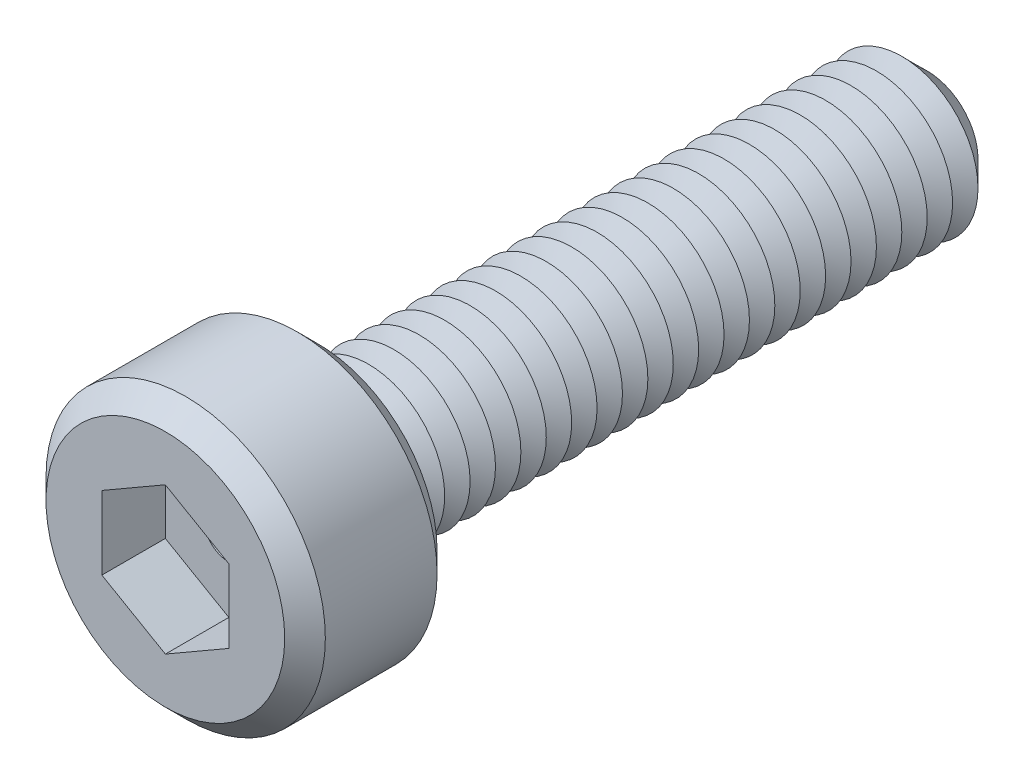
ISO-10303-21;
HEADER;
FILE_DESCRIPTION(('STEP AP214'),'2;1');
FILE_NAME('part.step','',(''),(''),'','','');
FILE_SCHEMA(('AUTOMOTIVE_DESIGN { 1 0 10303 214 1 1 1 1 }'));
ENDSEC;
DATA;
#1=APPLICATION_CONTEXT('core data for automotive mechanical design processes');
#2=APPLICATION_PROTOCOL_DEFINITION('international standard','automotive_design',2000,#1);
#3=PRODUCT_CONTEXT('',#1,'mechanical');
#4=PRODUCT('Part','Part','',(#3));
#5=PRODUCT_RELATED_PRODUCT_CATEGORY('part','',(#4));
#6=PRODUCT_DEFINITION_FORMATION('','',#4);
#7=PRODUCT_DEFINITION_CONTEXT('part definition',#1,'design');
#8=PRODUCT_DEFINITION('design','',#6,#7);
#9=PRODUCT_DEFINITION_SHAPE('','',#8);
#10=(LENGTH_UNIT() NAMED_UNIT(*) SI_UNIT(.MILLI.,.METRE.));
#11=(NAMED_UNIT(*) PLANE_ANGLE_UNIT() SI_UNIT($,.RADIAN.));
#12=(NAMED_UNIT(*) SI_UNIT($,.STERADIAN.) SOLID_ANGLE_UNIT());
#13=UNCERTAINTY_MEASURE_WITH_UNIT(LENGTH_MEASURE(1.E-05),#10,'distance_accuracy_value','');
#14=(GEOMETRIC_REPRESENTATION_CONTEXT(3) GLOBAL_UNCERTAINTY_ASSIGNED_CONTEXT((#13)) GLOBAL_UNIT_ASSIGNED_CONTEXT((#10,
#11,#12)) REPRESENTATION_CONTEXT('',''));
#15=CARTESIAN_POINT('',(0.,0.,0.));
#16=DIRECTION('',(0.,0.,1.));
#17=DIRECTION('',(1.,0.,0.));
#18=AXIS2_PLACEMENT_3D('',#15,#16,#17);
#19=CARTESIAN_POINT('',(0.,0.,3.));
#20=DIRECTION('',(0.,0.,-1.));
#21=DIRECTION('',(-1.,0.,0.));
#22=AXIS2_PLACEMENT_3D('',#19,#20,#21);
#23=CYLINDRICAL_SURFACE('',#22,2.75);
#24=CARTESIAN_POINT('',(0.,0.,0.4));
#25=DIRECTION('',(0.,0.,1.));
#26=DIRECTION('',(1.,0.,0.));
#27=AXIS2_PLACEMENT_3D('',#24,#25,#26);
#28=CIRCLE('',#27,2.75);
#29=CARTESIAN_POINT('',(2.75,0.,0.4));
#30=VERTEX_POINT('',#29);
#31=EDGE_CURVE('E360',#30,#30,#28,.T.);
#32=ORIENTED_EDGE('',*,*,#31,.T.);
#33=EDGE_LOOP('',(#32));
#34=FACE_BOUND('',#33,.T.);
#35=CARTESIAN_POINT('',(0.,0.,2.6));
#36=DIRECTION('',(0.,0.,1.));
#37=DIRECTION('',(1.,0.,0.));
#38=AXIS2_PLACEMENT_3D('',#35,#36,#37);
#39=CIRCLE('',#38,2.75);
#40=CARTESIAN_POINT('',(2.75,0.,2.6));
#41=VERTEX_POINT('',#40);
#42=EDGE_CURVE('E356',#41,#41,#39,.F.);
#43=ORIENTED_EDGE('',*,*,#42,.T.);
#44=EDGE_LOOP('',(#43));
#45=FACE_BOUND('',#44,.T.);
#46=ADVANCED_FACE('F39',(#34,#45),#23,.T.);
#47=CARTESIAN_POINT('',(0.,0.,3.));
#48=DIRECTION('',(0.,0.,1.));
#49=DIRECTION('',(1.,0.,0.));
#50=AXIS2_PLACEMENT_3D('',#47,#48,#49);
#51=PLANE('',#50);
#52=CARTESIAN_POINT('',(0.,0.,3.));
#53=DIRECTION('',(0.,0.,1.));
#54=DIRECTION('',(1.,0.,0.));
#55=AXIS2_PLACEMENT_3D('',#52,#53,#54);
#56=CIRCLE('',#55,2.35);
#57=CARTESIAN_POINT('',(2.35,0.,3.));
#58=VERTEX_POINT('',#57);
#59=EDGE_CURVE('E11',#58,#58,#56,.T.);
#60=ORIENTED_EDGE('',*,*,#59,.T.);
#61=EDGE_LOOP('',(#60));
#62=FACE_BOUND('',#61,.T.);
#63=DIRECTION('',(-0.866025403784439,0.5,0.));
#64=VECTOR('',#63,1.);
#65=CARTESIAN_POINT('',(1.25,0.721687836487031,3.));
#66=LINE('',#65,#64);
#67=CARTESIAN_POINT('',(1.25,0.721687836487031,3.));
#68=VERTEX_POINT('',#67);
#69=CARTESIAN_POINT('',(0.,1.44337567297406,3.));
#70=VERTEX_POINT('',#69);
#71=EDGE_CURVE('E55',#68,#70,#66,.T.);
#72=ORIENTED_EDGE('',*,*,#71,.F.);
#73=DIRECTION('',(0.,1.,0.));
#74=VECTOR('',#73,1.);
#75=CARTESIAN_POINT('',(1.25,-0.721687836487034,3.));
#76=LINE('',#75,#74);
#77=CARTESIAN_POINT('',(1.25,-0.721687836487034,3.));
#78=VERTEX_POINT('',#77);
#79=EDGE_CURVE('E151',#78,#68,#76,.T.);
#80=ORIENTED_EDGE('',*,*,#79,.F.);
#81=DIRECTION('',(0.866025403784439,0.5,0.));
#82=VECTOR('',#81,1.);
#83=CARTESIAN_POINT('',(0.,-1.44337567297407,3.));
#84=LINE('',#83,#82);
#85=CARTESIAN_POINT('',(0.,-1.44337567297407,3.));
#86=VERTEX_POINT('',#85);
#87=EDGE_CURVE('E148',#86,#78,#84,.T.);
#88=ORIENTED_EDGE('',*,*,#87,.F.);
#89=DIRECTION('',(0.866025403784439,-0.5,0.));
#90=VECTOR('',#89,1.);
#91=CARTESIAN_POINT('',(-1.25,-0.721687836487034,3.));
#92=LINE('',#91,#90);
#93=CARTESIAN_POINT('',(-1.25,-0.721687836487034,3.));
#94=VERTEX_POINT('',#93);
#95=EDGE_CURVE('E103',#94,#86,#92,.T.);
#96=ORIENTED_EDGE('',*,*,#95,.F.);
#97=DIRECTION('',(0.,-1.,0.));
#98=VECTOR('',#97,1.);
#99=CARTESIAN_POINT('',(-1.25,0.721687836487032,3.));
#100=LINE('',#99,#98);
#101=CARTESIAN_POINT('',(-1.25,0.721687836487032,3.));
#102=VERTEX_POINT('',#101);
#103=EDGE_CURVE('E142',#102,#94,#100,.T.);
#104=ORIENTED_EDGE('',*,*,#103,.F.);
#105=DIRECTION('',(-0.866025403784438,-0.5,0.));
#106=VECTOR('',#105,1.);
#107=CARTESIAN_POINT('',(0.,1.44337567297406,3.));
#108=LINE('',#107,#106);
#109=EDGE_CURVE('E137',#70,#102,#108,.T.);
#110=ORIENTED_EDGE('',*,*,#109,.F.);
#111=EDGE_LOOP('',(#72,#80,#88,#96,#104,#110));
#112=FACE_BOUND('',#111,.T.);
#113=ADVANCED_FACE('F378',(#62,#112),#51,.T.);
#114=CARTESIAN_POINT('',(0.,0.,0.));
#115=DIRECTION('',(0.,0.,1.));
#116=DIRECTION('',(1.,0.,0.));
#117=AXIS2_PLACEMENT_3D('',#114,#115,#116);
#118=PLANE('',#117);
#119=CARTESIAN_POINT('',(0.,0.,0.));
#120=DIRECTION('',(0.,0.,1.));
#121=DIRECTION('',(1.,0.,0.));
#122=AXIS2_PLACEMENT_3D('',#119,#120,#121);
#123=CIRCLE('',#122,2.35);
#124=CARTESIAN_POINT('',(2.35,0.,0.));
#125=VERTEX_POINT('',#124);
#126=EDGE_CURVE('E48',#125,#125,#123,.F.);
#127=ORIENTED_EDGE('',*,*,#126,.T.);
#128=EDGE_LOOP('',(#127));
#129=FACE_BOUND('',#128,.T.);
#130=CARTESIAN_POINT('',(0.,0.,0.));
#131=DIRECTION('',(0.,0.,1.));
#132=DIRECTION('',(1.,0.,0.));
#133=AXIS2_PLACEMENT_3D('',#130,#131,#132);
#134=CIRCLE('',#133,1.5);
#135=CARTESIAN_POINT('',(1.5,0.,0.));
#136=VERTEX_POINT('',#135);
#137=EDGE_CURVE('E348',#136,#136,#134,.T.);
#138=ORIENTED_EDGE('',*,*,#137,.T.);
#139=EDGE_LOOP('',(#138));
#140=FACE_BOUND('',#139,.T.);
#141=ADVANCED_FACE('F367',(#129,#140),#118,.F.);
#142=CARTESIAN_POINT('',(0.,0.,0.));
#143=DIRECTION('',(0.,0.,1.));
#144=DIRECTION('',(1.,0.,0.));
#145=AXIS2_PLACEMENT_3D('',#142,#143,#144);
#146=CONICAL_SURFACE('',#145,1.5,1.0471975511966);
#147=CARTESIAN_POINT('',(0.,0.,-0.250000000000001));
#148=DIRECTION('',(0.,0.,1.));
#149=DIRECTION('',(1.,0.,0.));
#150=AXIS2_PLACEMENT_3D('',#147,#148,#149);
#151=CIRCLE('',#150,1.06698729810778);
#152=CARTESIAN_POINT('',(1.06698729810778,0.,-0.250000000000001));
#153=VERTEX_POINT('',#152);
#154=EDGE_CURVE('E344',#153,#153,#151,.T.);
#155=ORIENTED_EDGE('',*,*,#154,.T.);
#156=EDGE_LOOP('',(#155));
#157=FACE_BOUND('',#156,.T.);
#158=ORIENTED_EDGE('',*,*,#137,.F.);
#159=EDGE_LOOP('',(#158));
#160=FACE_BOUND('',#159,.T.);
#161=ADVANCED_FACE('F612',(#157,#160),#146,.T.);
#162=CARTESIAN_POINT('',(0.,0.,-0.250000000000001));
#163=DIRECTION('',(0.,0.,-1.));
#164=DIRECTION('',(-1.,0.,0.));
#165=AXIS2_PLACEMENT_3D('',#162,#163,#164);
#166=CONICAL_SURFACE('',#165,1.06698729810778,1.0471975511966);
#167=CARTESIAN_POINT('',(0.,0.,-0.5));
#168=DIRECTION('',(0.,0.,1.));
#169=DIRECTION('',(1.,0.,0.));
#170=AXIS2_PLACEMENT_3D('',#167,#168,#169);
#171=CIRCLE('',#170,1.5);
#172=CARTESIAN_POINT('',(1.5,0.,-0.5));
#173=VERTEX_POINT('',#172);
#174=EDGE_CURVE('E340',#173,#173,#171,.T.);
#175=ORIENTED_EDGE('',*,*,#174,.T.);
#176=EDGE_LOOP('',(#175));
#177=FACE_BOUND('',#176,.T.);
#178=ORIENTED_EDGE('',*,*,#154,.F.);
#179=EDGE_LOOP('',(#178));
#180=FACE_BOUND('',#179,.T.);
#181=ADVANCED_FACE('F608',(#177,#180),#166,.T.);
#182=CARTESIAN_POINT('',(0.,0.,-0.5));
#183=DIRECTION('',(0.,0.,1.));
#184=DIRECTION('',(1.,0.,0.));
#185=AXIS2_PLACEMENT_3D('',#182,#183,#184);
#186=CONICAL_SURFACE('',#185,1.5,1.0471975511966);
#187=CARTESIAN_POINT('',(0.,0.,-0.750000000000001));
#188=DIRECTION('',(0.,0.,1.));
#189=DIRECTION('',(1.,0.,0.));
#190=AXIS2_PLACEMENT_3D('',#187,#188,#189);
#191=CIRCLE('',#190,1.06698729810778);
#192=CARTESIAN_POINT('',(1.06698729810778,0.,-0.750000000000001));
#193=VERTEX_POINT('',#192);
#194=EDGE_CURVE('E336',#193,#193,#191,.T.);
#195=ORIENTED_EDGE('',*,*,#194,.T.);
#196=EDGE_LOOP('',(#195));
#197=FACE_BOUND('',#196,.T.);
#198=ORIENTED_EDGE('',*,*,#174,.F.);
#199=EDGE_LOOP('',(#198));
#200=FACE_BOUND('',#199,.T.);
#201=ADVANCED_FACE('F604',(#197,#200),#186,.T.);
#202=CARTESIAN_POINT('',(0.,0.,-0.750000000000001));
#203=DIRECTION('',(0.,0.,-1.));
#204=DIRECTION('',(-1.,0.,0.));
#205=AXIS2_PLACEMENT_3D('',#202,#203,#204);
#206=CONICAL_SURFACE('',#205,1.06698729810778,1.0471975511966);
#207=CARTESIAN_POINT('',(0.,0.,-1.));
#208=DIRECTION('',(0.,0.,1.));
#209=DIRECTION('',(1.,0.,0.));
#210=AXIS2_PLACEMENT_3D('',#207,#208,#209);
#211=CIRCLE('',#210,1.5);
#212=CARTESIAN_POINT('',(1.5,0.,-1.));
#213=VERTEX_POINT('',#212);
#214=EDGE_CURVE('E332',#213,#213,#211,.T.);
#215=ORIENTED_EDGE('',*,*,#214,.T.);
#216=EDGE_LOOP('',(#215));
#217=FACE_BOUND('',#216,.T.);
#218=ORIENTED_EDGE('',*,*,#194,.F.);
#219=EDGE_LOOP('',(#218));
#220=FACE_BOUND('',#219,.T.);
#221=ADVANCED_FACE('F600',(#217,#220),#206,.T.);
#222=CARTESIAN_POINT('',(0.,0.,-1.));
#223=DIRECTION('',(0.,0.,1.));
#224=DIRECTION('',(1.,0.,0.));
#225=AXIS2_PLACEMENT_3D('',#222,#223,#224);
#226=CONICAL_SURFACE('',#225,1.5,1.0471975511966);
#227=CARTESIAN_POINT('',(0.,0.,-1.25));
#228=DIRECTION('',(0.,0.,1.));
#229=DIRECTION('',(1.,0.,0.));
#230=AXIS2_PLACEMENT_3D('',#227,#228,#229);
#231=CIRCLE('',#230,1.06698729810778);
#232=CARTESIAN_POINT('',(1.06698729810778,0.,-1.25));
#233=VERTEX_POINT('',#232);
#234=EDGE_CURVE('E328',#233,#233,#231,.T.);
#235=ORIENTED_EDGE('',*,*,#234,.T.);
#236=EDGE_LOOP('',(#235));
#237=FACE_BOUND('',#236,.T.);
#238=ORIENTED_EDGE('',*,*,#214,.F.);
#239=EDGE_LOOP('',(#238));
#240=FACE_BOUND('',#239,.T.);
#241=ADVANCED_FACE('F596',(#237,#240),#226,.T.);
#242=CARTESIAN_POINT('',(0.,0.,-1.25));
#243=DIRECTION('',(0.,0.,-1.));
#244=DIRECTION('',(-1.,0.,0.));
#245=AXIS2_PLACEMENT_3D('',#242,#243,#244);
#246=CONICAL_SURFACE('',#245,1.06698729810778,1.0471975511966);
#247=CARTESIAN_POINT('',(0.,0.,-1.5));
#248=DIRECTION('',(0.,0.,1.));
#249=DIRECTION('',(1.,0.,0.));
#250=AXIS2_PLACEMENT_3D('',#247,#248,#249);
#251=CIRCLE('',#250,1.5);
#252=CARTESIAN_POINT('',(1.5,0.,-1.5));
#253=VERTEX_POINT('',#252);
#254=EDGE_CURVE('E324',#253,#253,#251,.T.);
#255=ORIENTED_EDGE('',*,*,#254,.T.);
#256=EDGE_LOOP('',(#255));
#257=FACE_BOUND('',#256,.T.);
#258=ORIENTED_EDGE('',*,*,#234,.F.);
#259=EDGE_LOOP('',(#258));
#260=FACE_BOUND('',#259,.T.);
#261=ADVANCED_FACE('F592',(#257,#260),#246,.T.);
#262=CARTESIAN_POINT('',(0.,0.,-1.5));
#263=DIRECTION('',(0.,0.,1.));
#264=DIRECTION('',(1.,0.,0.));
#265=AXIS2_PLACEMENT_3D('',#262,#263,#264);
#266=CONICAL_SURFACE('',#265,1.5,1.0471975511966);
#267=CARTESIAN_POINT('',(0.,0.,-1.75));
#268=DIRECTION('',(0.,0.,1.));
#269=DIRECTION('',(1.,0.,0.));
#270=AXIS2_PLACEMENT_3D('',#267,#268,#269);
#271=CIRCLE('',#270,1.06698729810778);
#272=CARTESIAN_POINT('',(1.06698729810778,0.,-1.75));
#273=VERTEX_POINT('',#272);
#274=EDGE_CURVE('E320',#273,#273,#271,.T.);
#275=ORIENTED_EDGE('',*,*,#274,.T.);
#276=EDGE_LOOP('',(#275));
#277=FACE_BOUND('',#276,.T.);
#278=ORIENTED_EDGE('',*,*,#254,.F.);
#279=EDGE_LOOP('',(#278));
#280=FACE_BOUND('',#279,.T.);
#281=ADVANCED_FACE('F588',(#277,#280),#266,.T.);
#282=CARTESIAN_POINT('',(0.,0.,-1.75));
#283=DIRECTION('',(0.,0.,-1.));
#284=DIRECTION('',(-1.,0.,0.));
#285=AXIS2_PLACEMENT_3D('',#282,#283,#284);
#286=CONICAL_SURFACE('',#285,1.06698729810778,1.0471975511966);
#287=CARTESIAN_POINT('',(0.,0.,-2.));
#288=DIRECTION('',(0.,0.,1.));
#289=DIRECTION('',(1.,0.,0.));
#290=AXIS2_PLACEMENT_3D('',#287,#288,#289);
#291=CIRCLE('',#290,1.5);
#292=CARTESIAN_POINT('',(1.5,0.,-2.));
#293=VERTEX_POINT('',#292);
#294=EDGE_CURVE('E316',#293,#293,#291,.T.);
#295=ORIENTED_EDGE('',*,*,#294,.T.);
#296=EDGE_LOOP('',(#295));
#297=FACE_BOUND('',#296,.T.);
#298=ORIENTED_EDGE('',*,*,#274,.F.);
#299=EDGE_LOOP('',(#298));
#300=FACE_BOUND('',#299,.T.);
#301=ADVANCED_FACE('F584',(#297,#300),#286,.T.);
#302=CARTESIAN_POINT('',(0.,0.,-2.));
#303=DIRECTION('',(0.,0.,1.));
#304=DIRECTION('',(1.,0.,0.));
#305=AXIS2_PLACEMENT_3D('',#302,#303,#304);
#306=CONICAL_SURFACE('',#305,1.5,1.0471975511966);
#307=CARTESIAN_POINT('',(0.,0.,-2.25));
#308=DIRECTION('',(0.,0.,1.));
#309=DIRECTION('',(1.,0.,0.));
#310=AXIS2_PLACEMENT_3D('',#307,#308,#309);
#311=CIRCLE('',#310,1.06698729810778);
#312=CARTESIAN_POINT('',(1.06698729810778,0.,-2.25));
#313=VERTEX_POINT('',#312);
#314=EDGE_CURVE('E312',#313,#313,#311,.T.);
#315=ORIENTED_EDGE('',*,*,#314,.T.);
#316=EDGE_LOOP('',(#315));
#317=FACE_BOUND('',#316,.T.);
#318=ORIENTED_EDGE('',*,*,#294,.F.);
#319=EDGE_LOOP('',(#318));
#320=FACE_BOUND('',#319,.T.);
#321=ADVANCED_FACE('F580',(#317,#320),#306,.T.);
#322=CARTESIAN_POINT('',(0.,0.,-2.25));
#323=DIRECTION('',(0.,0.,-1.));
#324=DIRECTION('',(-1.,0.,0.));
#325=AXIS2_PLACEMENT_3D('',#322,#323,#324);
#326=CONICAL_SURFACE('',#325,1.06698729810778,1.0471975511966);
#327=CARTESIAN_POINT('',(0.,0.,-2.5));
#328=DIRECTION('',(0.,0.,1.));
#329=DIRECTION('',(1.,0.,0.));
#330=AXIS2_PLACEMENT_3D('',#327,#328,#329);
#331=CIRCLE('',#330,1.5);
#332=CARTESIAN_POINT('',(1.5,0.,-2.5));
#333=VERTEX_POINT('',#332);
#334=EDGE_CURVE('E308',#333,#333,#331,.T.);
#335=ORIENTED_EDGE('',*,*,#334,.T.);
#336=EDGE_LOOP('',(#335));
#337=FACE_BOUND('',#336,.T.);
#338=ORIENTED_EDGE('',*,*,#314,.F.);
#339=EDGE_LOOP('',(#338));
#340=FACE_BOUND('',#339,.T.);
#341=ADVANCED_FACE('F576',(#337,#340),#326,.T.);
#342=CARTESIAN_POINT('',(0.,0.,-2.5));
#343=DIRECTION('',(0.,0.,1.));
#344=DIRECTION('',(1.,0.,0.));
#345=AXIS2_PLACEMENT_3D('',#342,#343,#344);
#346=CONICAL_SURFACE('',#345,1.5,1.0471975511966);
#347=CARTESIAN_POINT('',(0.,0.,-2.75));
#348=DIRECTION('',(0.,0.,1.));
#349=DIRECTION('',(1.,0.,0.));
#350=AXIS2_PLACEMENT_3D('',#347,#348,#349);
#351=CIRCLE('',#350,1.06698729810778);
#352=CARTESIAN_POINT('',(1.06698729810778,0.,-2.75));
#353=VERTEX_POINT('',#352);
#354=EDGE_CURVE('E305',#353,#353,#351,.T.);
#355=ORIENTED_EDGE('',*,*,#354,.T.);
#356=EDGE_LOOP('',(#355));
#357=FACE_BOUND('',#356,.T.);
#358=ORIENTED_EDGE('',*,*,#334,.F.);
#359=EDGE_LOOP('',(#358));
#360=FACE_BOUND('',#359,.T.);
#361=ADVANCED_FACE('F572',(#357,#360),#346,.T.);
#362=CARTESIAN_POINT('',(0.,0.,-2.75));
#363=DIRECTION('',(0.,0.,-1.));
#364=DIRECTION('',(-1.,0.,0.));
#365=AXIS2_PLACEMENT_3D('',#362,#363,#364);
#366=CONICAL_SURFACE('',#365,1.06698729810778,1.0471975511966);
#367=CARTESIAN_POINT('',(0.,0.,-3.));
#368=DIRECTION('',(0.,0.,1.));
#369=DIRECTION('',(1.,0.,0.));
#370=AXIS2_PLACEMENT_3D('',#367,#368,#369);
#371=CIRCLE('',#370,1.5);
#372=CARTESIAN_POINT('',(1.5,0.,-3.));
#373=VERTEX_POINT('',#372);
#374=EDGE_CURVE('E301',#373,#373,#371,.T.);
#375=ORIENTED_EDGE('',*,*,#374,.T.);
#376=EDGE_LOOP('',(#375));
#377=FACE_BOUND('',#376,.T.);
#378=ORIENTED_EDGE('',*,*,#354,.F.);
#379=EDGE_LOOP('',(#378));
#380=FACE_BOUND('',#379,.T.);
#381=ADVANCED_FACE('F568',(#377,#380),#366,.T.);
#382=CARTESIAN_POINT('',(0.,0.,-3.));
#383=DIRECTION('',(0.,0.,1.));
#384=DIRECTION('',(1.,0.,0.));
#385=AXIS2_PLACEMENT_3D('',#382,#383,#384);
#386=CONICAL_SURFACE('',#385,1.5,1.0471975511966);
#387=CARTESIAN_POINT('',(0.,0.,-3.25));
#388=DIRECTION('',(0.,0.,1.));
#389=DIRECTION('',(1.,0.,0.));
#390=AXIS2_PLACEMENT_3D('',#387,#388,#389);
#391=CIRCLE('',#390,1.06698729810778);
#392=CARTESIAN_POINT('',(1.06698729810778,0.,-3.25));
#393=VERTEX_POINT('',#392);
#394=EDGE_CURVE('E297',#393,#393,#391,.T.);
#395=ORIENTED_EDGE('',*,*,#394,.T.);
#396=EDGE_LOOP('',(#395));
#397=FACE_BOUND('',#396,.T.);
#398=ORIENTED_EDGE('',*,*,#374,.F.);
#399=EDGE_LOOP('',(#398));
#400=FACE_BOUND('',#399,.T.);
#401=ADVANCED_FACE('F564',(#397,#400),#386,.T.);
#402=CARTESIAN_POINT('',(0.,0.,-3.25));
#403=DIRECTION('',(0.,0.,-1.));
#404=DIRECTION('',(-1.,0.,0.));
#405=AXIS2_PLACEMENT_3D('',#402,#403,#404);
#406=CONICAL_SURFACE('',#405,1.06698729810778,1.0471975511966);
#407=CARTESIAN_POINT('',(0.,0.,-3.5));
#408=DIRECTION('',(0.,0.,1.));
#409=DIRECTION('',(1.,0.,0.));
#410=AXIS2_PLACEMENT_3D('',#407,#408,#409);
#411=CIRCLE('',#410,1.5);
#412=CARTESIAN_POINT('',(1.5,0.,-3.5));
#413=VERTEX_POINT('',#412);
#414=EDGE_CURVE('E293',#413,#413,#411,.T.);
#415=ORIENTED_EDGE('',*,*,#414,.T.);
#416=EDGE_LOOP('',(#415));
#417=FACE_BOUND('',#416,.T.);
#418=ORIENTED_EDGE('',*,*,#394,.F.);
#419=EDGE_LOOP('',(#418));
#420=FACE_BOUND('',#419,.T.);
#421=ADVANCED_FACE('F560',(#417,#420),#406,.T.);
#422=CARTESIAN_POINT('',(0.,0.,-3.5));
#423=DIRECTION('',(0.,0.,1.));
#424=DIRECTION('',(1.,0.,0.));
#425=AXIS2_PLACEMENT_3D('',#422,#423,#424);
#426=CONICAL_SURFACE('',#425,1.5,1.0471975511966);
#427=CARTESIAN_POINT('',(0.,0.,-3.75));
#428=DIRECTION('',(0.,0.,1.));
#429=DIRECTION('',(1.,0.,0.));
#430=AXIS2_PLACEMENT_3D('',#427,#428,#429);
#431=CIRCLE('',#430,1.06698729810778);
#432=CARTESIAN_POINT('',(1.06698729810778,0.,-3.75));
#433=VERTEX_POINT('',#432);
#434=EDGE_CURVE('E289',#433,#433,#431,.T.);
#435=ORIENTED_EDGE('',*,*,#434,.T.);
#436=EDGE_LOOP('',(#435));
#437=FACE_BOUND('',#436,.T.);
#438=ORIENTED_EDGE('',*,*,#414,.F.);
#439=EDGE_LOOP('',(#438));
#440=FACE_BOUND('',#439,.T.);
#441=ADVANCED_FACE('F556',(#437,#440),#426,.T.);
#442=CARTESIAN_POINT('',(0.,0.,-3.75));
#443=DIRECTION('',(0.,0.,-1.));
#444=DIRECTION('',(-1.,0.,0.));
#445=AXIS2_PLACEMENT_3D('',#442,#443,#444);
#446=CONICAL_SURFACE('',#445,1.06698729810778,1.0471975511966);
#447=CARTESIAN_POINT('',(0.,0.,-4.));
#448=DIRECTION('',(0.,0.,1.));
#449=DIRECTION('',(1.,0.,0.));
#450=AXIS2_PLACEMENT_3D('',#447,#448,#449);
#451=CIRCLE('',#450,1.5);
#452=CARTESIAN_POINT('',(1.5,0.,-4.));
#453=VERTEX_POINT('',#452);
#454=EDGE_CURVE('E285',#453,#453,#451,.T.);
#455=ORIENTED_EDGE('',*,*,#454,.T.);
#456=EDGE_LOOP('',(#455));
#457=FACE_BOUND('',#456,.T.);
#458=ORIENTED_EDGE('',*,*,#434,.F.);
#459=EDGE_LOOP('',(#458));
#460=FACE_BOUND('',#459,.T.);
#461=ADVANCED_FACE('F552',(#457,#460),#446,.T.);
#462=CARTESIAN_POINT('',(0.,0.,-4.));
#463=DIRECTION('',(0.,0.,1.));
#464=DIRECTION('',(1.,0.,0.));
#465=AXIS2_PLACEMENT_3D('',#462,#463,#464);
#466=CONICAL_SURFACE('',#465,1.5,1.0471975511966);
#467=CARTESIAN_POINT('',(0.,0.,-4.25));
#468=DIRECTION('',(0.,0.,1.));
#469=DIRECTION('',(1.,0.,0.));
#470=AXIS2_PLACEMENT_3D('',#467,#468,#469);
#471=CIRCLE('',#470,1.06698729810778);
#472=CARTESIAN_POINT('',(1.06698729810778,0.,-4.25));
#473=VERTEX_POINT('',#472);
#474=EDGE_CURVE('E281',#473,#473,#471,.T.);
#475=ORIENTED_EDGE('',*,*,#474,.T.);
#476=EDGE_LOOP('',(#475));
#477=FACE_BOUND('',#476,.T.);
#478=ORIENTED_EDGE('',*,*,#454,.F.);
#479=EDGE_LOOP('',(#478));
#480=FACE_BOUND('',#479,.T.);
#481=ADVANCED_FACE('F548',(#477,#480),#466,.T.);
#482=CARTESIAN_POINT('',(0.,0.,-4.25));
#483=DIRECTION('',(0.,0.,-1.));
#484=DIRECTION('',(-1.,0.,0.));
#485=AXIS2_PLACEMENT_3D('',#482,#483,#484);
#486=CONICAL_SURFACE('',#485,1.06698729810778,1.0471975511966);
#487=CARTESIAN_POINT('',(0.,0.,-4.5));
#488=DIRECTION('',(0.,0.,1.));
#489=DIRECTION('',(1.,0.,0.));
#490=AXIS2_PLACEMENT_3D('',#487,#488,#489);
#491=CIRCLE('',#490,1.5);
#492=CARTESIAN_POINT('',(1.5,0.,-4.5));
#493=VERTEX_POINT('',#492);
#494=EDGE_CURVE('E277',#493,#493,#491,.T.);
#495=ORIENTED_EDGE('',*,*,#494,.T.);
#496=EDGE_LOOP('',(#495));
#497=FACE_BOUND('',#496,.T.);
#498=ORIENTED_EDGE('',*,*,#474,.F.);
#499=EDGE_LOOP('',(#498));
#500=FACE_BOUND('',#499,.T.);
#501=ADVANCED_FACE('F544',(#497,#500),#486,.T.);
#502=CARTESIAN_POINT('',(0.,0.,-4.5));
#503=DIRECTION('',(0.,0.,1.));
#504=DIRECTION('',(1.,0.,0.));
#505=AXIS2_PLACEMENT_3D('',#502,#503,#504);
#506=CONICAL_SURFACE('',#505,1.5,1.0471975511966);
#507=CARTESIAN_POINT('',(0.,0.,-4.75));
#508=DIRECTION('',(0.,0.,1.));
#509=DIRECTION('',(1.,0.,0.));
#510=AXIS2_PLACEMENT_3D('',#507,#508,#509);
#511=CIRCLE('',#510,1.06698729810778);
#512=CARTESIAN_POINT('',(1.06698729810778,0.,-4.75));
#513=VERTEX_POINT('',#512);
#514=EDGE_CURVE('E273',#513,#513,#511,.T.);
#515=ORIENTED_EDGE('',*,*,#514,.T.);
#516=EDGE_LOOP('',(#515));
#517=FACE_BOUND('',#516,.T.);
#518=ORIENTED_EDGE('',*,*,#494,.F.);
#519=EDGE_LOOP('',(#518));
#520=FACE_BOUND('',#519,.T.);
#521=ADVANCED_FACE('F540',(#517,#520),#506,.T.);
#522=CARTESIAN_POINT('',(0.,0.,-4.75));
#523=DIRECTION('',(0.,0.,-1.));
#524=DIRECTION('',(-1.,0.,0.));
#525=AXIS2_PLACEMENT_3D('',#522,#523,#524);
#526=CONICAL_SURFACE('',#525,1.06698729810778,1.0471975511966);
#527=CARTESIAN_POINT('',(0.,0.,-5.));
#528=DIRECTION('',(0.,0.,1.));
#529=DIRECTION('',(1.,0.,0.));
#530=AXIS2_PLACEMENT_3D('',#527,#528,#529);
#531=CIRCLE('',#530,1.5);
#532=CARTESIAN_POINT('',(1.5,0.,-5.));
#533=VERTEX_POINT('',#532);
#534=EDGE_CURVE('E269',#533,#533,#531,.T.);
#535=ORIENTED_EDGE('',*,*,#534,.T.);
#536=EDGE_LOOP('',(#535));
#537=FACE_BOUND('',#536,.T.);
#538=ORIENTED_EDGE('',*,*,#514,.F.);
#539=EDGE_LOOP('',(#538));
#540=FACE_BOUND('',#539,.T.);
#541=ADVANCED_FACE('F536',(#537,#540),#526,.T.);
#542=CARTESIAN_POINT('',(0.,0.,-5.));
#543=DIRECTION('',(0.,0.,1.));
#544=DIRECTION('',(1.,0.,0.));
#545=AXIS2_PLACEMENT_3D('',#542,#543,#544);
#546=CONICAL_SURFACE('',#545,1.5,1.0471975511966);
#547=CARTESIAN_POINT('',(0.,0.,-5.25));
#548=DIRECTION('',(0.,0.,1.));
#549=DIRECTION('',(1.,0.,0.));
#550=AXIS2_PLACEMENT_3D('',#547,#548,#549);
#551=CIRCLE('',#550,1.06698729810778);
#552=CARTESIAN_POINT('',(1.06698729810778,0.,-5.25));
#553=VERTEX_POINT('',#552);
#554=EDGE_CURVE('E265',#553,#553,#551,.T.);
#555=ORIENTED_EDGE('',*,*,#554,.T.);
#556=EDGE_LOOP('',(#555));
#557=FACE_BOUND('',#556,.T.);
#558=ORIENTED_EDGE('',*,*,#534,.F.);
#559=EDGE_LOOP('',(#558));
#560=FACE_BOUND('',#559,.T.);
#561=ADVANCED_FACE('F532',(#557,#560),#546,.T.);
#562=CARTESIAN_POINT('',(0.,0.,-5.25));
#563=DIRECTION('',(0.,0.,-1.));
#564=DIRECTION('',(-1.,0.,0.));
#565=AXIS2_PLACEMENT_3D('',#562,#563,#564);
#566=CONICAL_SURFACE('',#565,1.06698729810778,1.0471975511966);
#567=CARTESIAN_POINT('',(0.,0.,-5.5));
#568=DIRECTION('',(0.,0.,1.));
#569=DIRECTION('',(1.,0.,0.));
#570=AXIS2_PLACEMENT_3D('',#567,#568,#569);
#571=CIRCLE('',#570,1.5);
#572=CARTESIAN_POINT('',(1.5,0.,-5.5));
#573=VERTEX_POINT('',#572);
#574=EDGE_CURVE('E261',#573,#573,#571,.T.);
#575=ORIENTED_EDGE('',*,*,#574,.T.);
#576=EDGE_LOOP('',(#575));
#577=FACE_BOUND('',#576,.T.);
#578=ORIENTED_EDGE('',*,*,#554,.F.);
#579=EDGE_LOOP('',(#578));
#580=FACE_BOUND('',#579,.T.);
#581=ADVANCED_FACE('F528',(#577,#580),#566,.T.);
#582=CARTESIAN_POINT('',(0.,0.,-5.5));
#583=DIRECTION('',(0.,0.,1.));
#584=DIRECTION('',(1.,0.,0.));
#585=AXIS2_PLACEMENT_3D('',#582,#583,#584);
#586=CONICAL_SURFACE('',#585,1.5,1.0471975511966);
#587=CARTESIAN_POINT('',(0.,0.,-5.75));
#588=DIRECTION('',(0.,0.,1.));
#589=DIRECTION('',(1.,0.,0.));
#590=AXIS2_PLACEMENT_3D('',#587,#588,#589);
#591=CIRCLE('',#590,1.06698729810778);
#592=CARTESIAN_POINT('',(1.06698729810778,0.,-5.75));
#593=VERTEX_POINT('',#592);
#594=EDGE_CURVE('E257',#593,#593,#591,.T.);
#595=ORIENTED_EDGE('',*,*,#594,.T.);
#596=EDGE_LOOP('',(#595));
#597=FACE_BOUND('',#596,.T.);
#598=ORIENTED_EDGE('',*,*,#574,.F.);
#599=EDGE_LOOP('',(#598));
#600=FACE_BOUND('',#599,.T.);
#601=ADVANCED_FACE('F524',(#597,#600),#586,.T.);
#602=CARTESIAN_POINT('',(0.,0.,-5.75));
#603=DIRECTION('',(0.,0.,-1.));
#604=DIRECTION('',(-1.,0.,0.));
#605=AXIS2_PLACEMENT_3D('',#602,#603,#604);
#606=CONICAL_SURFACE('',#605,1.06698729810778,1.0471975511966);
#607=CARTESIAN_POINT('',(0.,0.,-6.));
#608=DIRECTION('',(0.,0.,1.));
#609=DIRECTION('',(1.,0.,0.));
#610=AXIS2_PLACEMENT_3D('',#607,#608,#609);
#611=CIRCLE('',#610,1.5);
#612=CARTESIAN_POINT('',(1.5,0.,-6.));
#613=VERTEX_POINT('',#612);
#614=EDGE_CURVE('E253',#613,#613,#611,.T.);
#615=ORIENTED_EDGE('',*,*,#614,.T.);
#616=EDGE_LOOP('',(#615));
#617=FACE_BOUND('',#616,.T.);
#618=ORIENTED_EDGE('',*,*,#594,.F.);
#619=EDGE_LOOP('',(#618));
#620=FACE_BOUND('',#619,.T.);
#621=ADVANCED_FACE('F520',(#617,#620),#606,.T.);
#622=CARTESIAN_POINT('',(0.,0.,-6.));
#623=DIRECTION('',(0.,0.,1.));
#624=DIRECTION('',(1.,0.,0.));
#625=AXIS2_PLACEMENT_3D('',#622,#623,#624);
#626=CONICAL_SURFACE('',#625,1.5,1.0471975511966);
#627=CARTESIAN_POINT('',(0.,0.,-6.25));
#628=DIRECTION('',(0.,0.,1.));
#629=DIRECTION('',(1.,0.,0.));
#630=AXIS2_PLACEMENT_3D('',#627,#628,#629);
#631=CIRCLE('',#630,1.06698729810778);
#632=CARTESIAN_POINT('',(1.06698729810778,0.,-6.25));
#633=VERTEX_POINT('',#632);
#634=EDGE_CURVE('E249',#633,#633,#631,.T.);
#635=ORIENTED_EDGE('',*,*,#634,.T.);
#636=EDGE_LOOP('',(#635));
#637=FACE_BOUND('',#636,.T.);
#638=ORIENTED_EDGE('',*,*,#614,.F.);
#639=EDGE_LOOP('',(#638));
#640=FACE_BOUND('',#639,.T.);
#641=ADVANCED_FACE('F516',(#637,#640),#626,.T.);
#642=CARTESIAN_POINT('',(0.,0.,-6.25));
#643=DIRECTION('',(0.,0.,-1.));
#644=DIRECTION('',(-1.,0.,0.));
#645=AXIS2_PLACEMENT_3D('',#642,#643,#644);
#646=CONICAL_SURFACE('',#645,1.06698729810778,1.0471975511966);
#647=CARTESIAN_POINT('',(0.,0.,-6.5));
#648=DIRECTION('',(0.,0.,1.));
#649=DIRECTION('',(1.,0.,0.));
#650=AXIS2_PLACEMENT_3D('',#647,#648,#649);
#651=CIRCLE('',#650,1.5);
#652=CARTESIAN_POINT('',(1.5,0.,-6.5));
#653=VERTEX_POINT('',#652);
#654=EDGE_CURVE('E245',#653,#653,#651,.T.);
#655=ORIENTED_EDGE('',*,*,#654,.T.);
#656=EDGE_LOOP('',(#655));
#657=FACE_BOUND('',#656,.T.);
#658=ORIENTED_EDGE('',*,*,#634,.F.);
#659=EDGE_LOOP('',(#658));
#660=FACE_BOUND('',#659,.T.);
#661=ADVANCED_FACE('F512',(#657,#660),#646,.T.);
#662=CARTESIAN_POINT('',(0.,0.,-6.5));
#663=DIRECTION('',(0.,0.,1.));
#664=DIRECTION('',(1.,0.,0.));
#665=AXIS2_PLACEMENT_3D('',#662,#663,#664);
#666=CONICAL_SURFACE('',#665,1.5,1.0471975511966);
#667=CARTESIAN_POINT('',(0.,0.,-6.75));
#668=DIRECTION('',(0.,0.,1.));
#669=DIRECTION('',(1.,0.,0.));
#670=AXIS2_PLACEMENT_3D('',#667,#668,#669);
#671=CIRCLE('',#670,1.06698729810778);
#672=CARTESIAN_POINT('',(1.06698729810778,0.,-6.75));
#673=VERTEX_POINT('',#672);
#674=EDGE_CURVE('E241',#673,#673,#671,.T.);
#675=ORIENTED_EDGE('',*,*,#674,.T.);
#676=EDGE_LOOP('',(#675));
#677=FACE_BOUND('',#676,.T.);
#678=ORIENTED_EDGE('',*,*,#654,.F.);
#679=EDGE_LOOP('',(#678));
#680=FACE_BOUND('',#679,.T.);
#681=ADVANCED_FACE('F508',(#677,#680),#666,.T.);
#682=CARTESIAN_POINT('',(0.,0.,-6.75));
#683=DIRECTION('',(0.,0.,-1.));
#684=DIRECTION('',(-1.,0.,0.));
#685=AXIS2_PLACEMENT_3D('',#682,#683,#684);
#686=CONICAL_SURFACE('',#685,1.06698729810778,1.0471975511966);
#687=CARTESIAN_POINT('',(0.,0.,-7.));
#688=DIRECTION('',(0.,0.,1.));
#689=DIRECTION('',(1.,0.,0.));
#690=AXIS2_PLACEMENT_3D('',#687,#688,#689);
#691=CIRCLE('',#690,1.5);
#692=CARTESIAN_POINT('',(1.5,0.,-7.));
#693=VERTEX_POINT('',#692);
#694=EDGE_CURVE('E237',#693,#693,#691,.T.);
#695=ORIENTED_EDGE('',*,*,#694,.T.);
#696=EDGE_LOOP('',(#695));
#697=FACE_BOUND('',#696,.T.);
#698=ORIENTED_EDGE('',*,*,#674,.F.);
#699=EDGE_LOOP('',(#698));
#700=FACE_BOUND('',#699,.T.);
#701=ADVANCED_FACE('F504',(#697,#700),#686,.T.);
#702=CARTESIAN_POINT('',(0.,0.,-7.));
#703=DIRECTION('',(0.,0.,1.));
#704=DIRECTION('',(1.,0.,0.));
#705=AXIS2_PLACEMENT_3D('',#702,#703,#704);
#706=CONICAL_SURFACE('',#705,1.5,1.0471975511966);
#707=CARTESIAN_POINT('',(0.,0.,-7.25));
#708=DIRECTION('',(0.,0.,1.));
#709=DIRECTION('',(1.,0.,0.));
#710=AXIS2_PLACEMENT_3D('',#707,#708,#709);
#711=CIRCLE('',#710,1.06698729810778);
#712=CARTESIAN_POINT('',(1.06698729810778,0.,-7.25));
#713=VERTEX_POINT('',#712);
#714=EDGE_CURVE('E234',#713,#713,#711,.T.);
#715=ORIENTED_EDGE('',*,*,#714,.T.);
#716=EDGE_LOOP('',(#715));
#717=FACE_BOUND('',#716,.T.);
#718=ORIENTED_EDGE('',*,*,#694,.F.);
#719=EDGE_LOOP('',(#718));
#720=FACE_BOUND('',#719,.T.);
#721=ADVANCED_FACE('F500',(#717,#720),#706,.T.);
#722=CARTESIAN_POINT('',(0.,0.,-7.25));
#723=DIRECTION('',(0.,0.,-1.));
#724=DIRECTION('',(-1.,0.,0.));
#725=AXIS2_PLACEMENT_3D('',#722,#723,#724);
#726=CONICAL_SURFACE('',#725,1.06698729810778,1.0471975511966);
#727=CARTESIAN_POINT('',(0.,0.,-7.5));
#728=DIRECTION('',(0.,0.,1.));
#729=DIRECTION('',(1.,0.,0.));
#730=AXIS2_PLACEMENT_3D('',#727,#728,#729);
#731=CIRCLE('',#730,1.5);
#732=CARTESIAN_POINT('',(1.5,0.,-7.5));
#733=VERTEX_POINT('',#732);
#734=EDGE_CURVE('E230',#733,#733,#731,.T.);
#735=ORIENTED_EDGE('',*,*,#734,.T.);
#736=EDGE_LOOP('',(#735));
#737=FACE_BOUND('',#736,.T.);
#738=ORIENTED_EDGE('',*,*,#714,.F.);
#739=EDGE_LOOP('',(#738));
#740=FACE_BOUND('',#739,.T.);
#741=ADVANCED_FACE('F496',(#737,#740),#726,.T.);
#742=CARTESIAN_POINT('',(0.,0.,-7.5));
#743=DIRECTION('',(0.,0.,1.));
#744=DIRECTION('',(1.,0.,0.));
#745=AXIS2_PLACEMENT_3D('',#742,#743,#744);
#746=CONICAL_SURFACE('',#745,1.5,1.0471975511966);
#747=CARTESIAN_POINT('',(0.,0.,-7.75));
#748=DIRECTION('',(0.,0.,1.));
#749=DIRECTION('',(1.,0.,0.));
#750=AXIS2_PLACEMENT_3D('',#747,#748,#749);
#751=CIRCLE('',#750,1.06698729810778);
#752=CARTESIAN_POINT('',(1.06698729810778,0.,-7.75));
#753=VERTEX_POINT('',#752);
#754=EDGE_CURVE('E226',#753,#753,#751,.T.);
#755=ORIENTED_EDGE('',*,*,#754,.T.);
#756=EDGE_LOOP('',(#755));
#757=FACE_BOUND('',#756,.T.);
#758=ORIENTED_EDGE('',*,*,#734,.F.);
#759=EDGE_LOOP('',(#758));
#760=FACE_BOUND('',#759,.T.);
#761=ADVANCED_FACE('F492',(#757,#760),#746,.T.);
#762=CARTESIAN_POINT('',(0.,0.,-7.75));
#763=DIRECTION('',(0.,0.,-1.));
#764=DIRECTION('',(-1.,0.,0.));
#765=AXIS2_PLACEMENT_3D('',#762,#763,#764);
#766=CONICAL_SURFACE('',#765,1.06698729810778,1.0471975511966);
#767=CARTESIAN_POINT('',(0.,0.,-8.));
#768=DIRECTION('',(0.,0.,1.));
#769=DIRECTION('',(1.,0.,0.));
#770=AXIS2_PLACEMENT_3D('',#767,#768,#769);
#771=CIRCLE('',#770,1.5);
#772=CARTESIAN_POINT('',(1.5,0.,-8.));
#773=VERTEX_POINT('',#772);
#774=EDGE_CURVE('E222',#773,#773,#771,.T.);
#775=ORIENTED_EDGE('',*,*,#774,.T.);
#776=EDGE_LOOP('',(#775));
#777=FACE_BOUND('',#776,.T.);
#778=ORIENTED_EDGE('',*,*,#754,.F.);
#779=EDGE_LOOP('',(#778));
#780=FACE_BOUND('',#779,.T.);
#781=ADVANCED_FACE('F488',(#777,#780),#766,.T.);
#782=CARTESIAN_POINT('',(0.,0.,-8.));
#783=DIRECTION('',(0.,0.,1.));
#784=DIRECTION('',(1.,0.,0.));
#785=AXIS2_PLACEMENT_3D('',#782,#783,#784);
#786=CONICAL_SURFACE('',#785,1.5,1.0471975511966);
#787=CARTESIAN_POINT('',(0.,0.,-8.25));
#788=DIRECTION('',(0.,0.,1.));
#789=DIRECTION('',(1.,0.,0.));
#790=AXIS2_PLACEMENT_3D('',#787,#788,#789);
#791=CIRCLE('',#790,1.06698729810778);
#792=CARTESIAN_POINT('',(1.06698729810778,0.,-8.25));
#793=VERTEX_POINT('',#792);
#794=EDGE_CURVE('E218',#793,#793,#791,.T.);
#795=ORIENTED_EDGE('',*,*,#794,.T.);
#796=EDGE_LOOP('',(#795));
#797=FACE_BOUND('',#796,.T.);
#798=ORIENTED_EDGE('',*,*,#774,.F.);
#799=EDGE_LOOP('',(#798));
#800=FACE_BOUND('',#799,.T.);
#801=ADVANCED_FACE('F484',(#797,#800),#786,.T.);
#802=CARTESIAN_POINT('',(0.,0.,-8.25));
#803=DIRECTION('',(0.,0.,-1.));
#804=DIRECTION('',(-1.,0.,0.));
#805=AXIS2_PLACEMENT_3D('',#802,#803,#804);
#806=CONICAL_SURFACE('',#805,1.06698729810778,1.0471975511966);
#807=CARTESIAN_POINT('',(0.,0.,-8.5));
#808=DIRECTION('',(0.,0.,1.));
#809=DIRECTION('',(1.,0.,0.));
#810=AXIS2_PLACEMENT_3D('',#807,#808,#809);
#811=CIRCLE('',#810,1.5);
#812=CARTESIAN_POINT('',(1.5,0.,-8.5));
#813=VERTEX_POINT('',#812);
#814=EDGE_CURVE('E214',#813,#813,#811,.T.);
#815=ORIENTED_EDGE('',*,*,#814,.T.);
#816=EDGE_LOOP('',(#815));
#817=FACE_BOUND('',#816,.T.);
#818=ORIENTED_EDGE('',*,*,#794,.F.);
#819=EDGE_LOOP('',(#818));
#820=FACE_BOUND('',#819,.T.);
#821=ADVANCED_FACE('F480',(#817,#820),#806,.T.);
#822=CARTESIAN_POINT('',(0.,0.,-8.5));
#823=DIRECTION('',(0.,0.,1.));
#824=DIRECTION('',(1.,0.,0.));
#825=AXIS2_PLACEMENT_3D('',#822,#823,#824);
#826=CONICAL_SURFACE('',#825,1.5,1.0471975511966);
#827=CARTESIAN_POINT('',(0.,0.,-8.75));
#828=DIRECTION('',(0.,0.,1.));
#829=DIRECTION('',(1.,0.,0.));
#830=AXIS2_PLACEMENT_3D('',#827,#828,#829);
#831=CIRCLE('',#830,1.06698729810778);
#832=CARTESIAN_POINT('',(1.06698729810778,0.,-8.75));
#833=VERTEX_POINT('',#832);
#834=EDGE_CURVE('E210',#833,#833,#831,.T.);
#835=ORIENTED_EDGE('',*,*,#834,.T.);
#836=EDGE_LOOP('',(#835));
#837=FACE_BOUND('',#836,.T.);
#838=ORIENTED_EDGE('',*,*,#814,.F.);
#839=EDGE_LOOP('',(#838));
#840=FACE_BOUND('',#839,.T.);
#841=ADVANCED_FACE('F476',(#837,#840),#826,.T.);
#842=CARTESIAN_POINT('',(0.,0.,-8.75));
#843=DIRECTION('',(0.,0.,-1.));
#844=DIRECTION('',(-1.,0.,0.));
#845=AXIS2_PLACEMENT_3D('',#842,#843,#844);
#846=CONICAL_SURFACE('',#845,1.06698729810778,1.0471975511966);
#847=CARTESIAN_POINT('',(0.,0.,-9.));
#848=DIRECTION('',(0.,0.,1.));
#849=DIRECTION('',(1.,0.,0.));
#850=AXIS2_PLACEMENT_3D('',#847,#848,#849);
#851=CIRCLE('',#850,1.5);
#852=CARTESIAN_POINT('',(1.5,0.,-9.));
#853=VERTEX_POINT('',#852);
#854=EDGE_CURVE('E206',#853,#853,#851,.T.);
#855=ORIENTED_EDGE('',*,*,#854,.T.);
#856=EDGE_LOOP('',(#855));
#857=FACE_BOUND('',#856,.T.);
#858=ORIENTED_EDGE('',*,*,#834,.F.);
#859=EDGE_LOOP('',(#858));
#860=FACE_BOUND('',#859,.T.);
#861=ADVANCED_FACE('F472',(#857,#860),#846,.T.);
#862=CARTESIAN_POINT('',(0.,0.,-9.));
#863=DIRECTION('',(0.,0.,1.));
#864=DIRECTION('',(1.,0.,0.));
#865=AXIS2_PLACEMENT_3D('',#862,#863,#864);
#866=CONICAL_SURFACE('',#865,1.5,1.0471975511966);
#867=CARTESIAN_POINT('',(0.,0.,-9.25));
#868=DIRECTION('',(0.,0.,1.));
#869=DIRECTION('',(1.,0.,0.));
#870=AXIS2_PLACEMENT_3D('',#867,#868,#869);
#871=CIRCLE('',#870,1.06698729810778);
#872=CARTESIAN_POINT('',(1.06698729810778,0.,-9.25));
#873=VERTEX_POINT('',#872);
#874=EDGE_CURVE('E202',#873,#873,#871,.T.);
#875=ORIENTED_EDGE('',*,*,#874,.T.);
#876=EDGE_LOOP('',(#875));
#877=FACE_BOUND('',#876,.T.);
#878=ORIENTED_EDGE('',*,*,#854,.F.);
#879=EDGE_LOOP('',(#878));
#880=FACE_BOUND('',#879,.T.);
#881=ADVANCED_FACE('F468',(#877,#880),#866,.T.);
#882=CARTESIAN_POINT('',(0.,0.,-9.25));
#883=DIRECTION('',(0.,0.,-1.));
#884=DIRECTION('',(-1.,0.,0.));
#885=AXIS2_PLACEMENT_3D('',#882,#883,#884);
#886=CONICAL_SURFACE('',#885,1.06698729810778,1.0471975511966);
#887=CARTESIAN_POINT('',(0.,0.,-9.5));
#888=DIRECTION('',(0.,0.,1.));
#889=DIRECTION('',(1.,0.,0.));
#890=AXIS2_PLACEMENT_3D('',#887,#888,#889);
#891=CIRCLE('',#890,1.5);
#892=CARTESIAN_POINT('',(1.5,0.,-9.5));
#893=VERTEX_POINT('',#892);
#894=EDGE_CURVE('E198',#893,#893,#891,.T.);
#895=ORIENTED_EDGE('',*,*,#894,.T.);
#896=EDGE_LOOP('',(#895));
#897=FACE_BOUND('',#896,.T.);
#898=ORIENTED_EDGE('',*,*,#874,.F.);
#899=EDGE_LOOP('',(#898));
#900=FACE_BOUND('',#899,.T.);
#901=ADVANCED_FACE('F464',(#897,#900),#886,.T.);
#902=CARTESIAN_POINT('',(0.,0.,-9.5));
#903=DIRECTION('',(0.,0.,1.));
#904=DIRECTION('',(1.,0.,0.));
#905=AXIS2_PLACEMENT_3D('',#902,#903,#904);
#906=CONICAL_SURFACE('',#905,1.5,1.0471975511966);
#907=CARTESIAN_POINT('',(0.,0.,-9.75));
#908=DIRECTION('',(0.,0.,1.));
#909=DIRECTION('',(1.,0.,0.));
#910=AXIS2_PLACEMENT_3D('',#907,#908,#909);
#911=CIRCLE('',#910,1.06698729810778);
#912=CARTESIAN_POINT('',(1.06698729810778,0.,-9.75));
#913=VERTEX_POINT('',#912);
#914=EDGE_CURVE('E194',#913,#913,#911,.T.);
#915=ORIENTED_EDGE('',*,*,#914,.T.);
#916=EDGE_LOOP('',(#915));
#917=FACE_BOUND('',#916,.T.);
#918=ORIENTED_EDGE('',*,*,#894,.F.);
#919=EDGE_LOOP('',(#918));
#920=FACE_BOUND('',#919,.T.);
#921=ADVANCED_FACE('F460',(#917,#920),#906,.T.);
#922=CARTESIAN_POINT('',(0.,0.,-9.75));
#923=DIRECTION('',(0.,0.,-1.));
#924=DIRECTION('',(-1.,0.,0.));
#925=AXIS2_PLACEMENT_3D('',#922,#923,#924);
#926=CONICAL_SURFACE('',#925,1.06698729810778,1.0471975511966);
#927=CARTESIAN_POINT('',(0.,0.,-10.));
#928=DIRECTION('',(0.,0.,1.));
#929=DIRECTION('',(1.,0.,0.));
#930=AXIS2_PLACEMENT_3D('',#927,#928,#929);
#931=CIRCLE('',#930,1.5);
#932=CARTESIAN_POINT('',(1.5,0.,-10.));
#933=VERTEX_POINT('',#932);
#934=EDGE_CURVE('E190',#933,#933,#931,.T.);
#935=ORIENTED_EDGE('',*,*,#934,.T.);
#936=EDGE_LOOP('',(#935));
#937=FACE_BOUND('',#936,.T.);
#938=ORIENTED_EDGE('',*,*,#914,.F.);
#939=EDGE_LOOP('',(#938));
#940=FACE_BOUND('',#939,.T.);
#941=ADVANCED_FACE('F456',(#937,#940),#926,.T.);
#942=CARTESIAN_POINT('',(0.,0.,-10.));
#943=DIRECTION('',(0.,0.,1.));
#944=DIRECTION('',(1.,0.,0.));
#945=AXIS2_PLACEMENT_3D('',#942,#943,#944);
#946=CONICAL_SURFACE('',#945,1.5,1.0471975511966);
#947=CARTESIAN_POINT('',(0.,0.,-10.25));
#948=DIRECTION('',(0.,0.,1.));
#949=DIRECTION('',(1.,0.,0.));
#950=AXIS2_PLACEMENT_3D('',#947,#948,#949);
#951=CIRCLE('',#950,1.06698729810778);
#952=CARTESIAN_POINT('',(1.06698729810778,0.,-10.25));
#953=VERTEX_POINT('',#952);
#954=EDGE_CURVE('E186',#953,#953,#951,.T.);
#955=ORIENTED_EDGE('',*,*,#954,.T.);
#956=EDGE_LOOP('',(#955));
#957=FACE_BOUND('',#956,.T.);
#958=ORIENTED_EDGE('',*,*,#934,.F.);
#959=EDGE_LOOP('',(#958));
#960=FACE_BOUND('',#959,.T.);
#961=ADVANCED_FACE('F452',(#957,#960),#946,.T.);
#962=CARTESIAN_POINT('',(0.,0.,-10.25));
#963=DIRECTION('',(0.,0.,-1.));
#964=DIRECTION('',(-1.,0.,0.));
#965=AXIS2_PLACEMENT_3D('',#962,#963,#964);
#966=CONICAL_SURFACE('',#965,1.06698729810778,1.0471975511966);
#967=CARTESIAN_POINT('',(0.,0.,-10.5));
#968=DIRECTION('',(0.,0.,1.));
#969=DIRECTION('',(1.,0.,0.));
#970=AXIS2_PLACEMENT_3D('',#967,#968,#969);
#971=CIRCLE('',#970,1.5);
#972=CARTESIAN_POINT('',(1.5,0.,-10.5));
#973=VERTEX_POINT('',#972);
#974=EDGE_CURVE('E182',#973,#973,#971,.T.);
#975=ORIENTED_EDGE('',*,*,#974,.T.);
#976=EDGE_LOOP('',(#975));
#977=FACE_BOUND('',#976,.T.);
#978=ORIENTED_EDGE('',*,*,#954,.F.);
#979=EDGE_LOOP('',(#978));
#980=FACE_BOUND('',#979,.T.);
#981=ADVANCED_FACE('F448',(#977,#980),#966,.T.);
#982=CARTESIAN_POINT('',(0.,0.,-10.5));
#983=DIRECTION('',(0.,0.,1.));
#984=DIRECTION('',(1.,0.,0.));
#985=AXIS2_PLACEMENT_3D('',#982,#983,#984);
#986=CONICAL_SURFACE('',#985,1.5,1.0471975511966);
#987=CARTESIAN_POINT('',(0.,0.,-10.75));
#988=DIRECTION('',(0.,0.,1.));
#989=DIRECTION('',(1.,0.,0.));
#990=AXIS2_PLACEMENT_3D('',#987,#988,#989);
#991=CIRCLE('',#990,1.06698729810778);
#992=CARTESIAN_POINT('',(1.06698729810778,0.,-10.75));
#993=VERTEX_POINT('',#992);
#994=EDGE_CURVE('E178',#993,#993,#991,.T.);
#995=ORIENTED_EDGE('',*,*,#994,.T.);
#996=EDGE_LOOP('',(#995));
#997=FACE_BOUND('',#996,.T.);
#998=ORIENTED_EDGE('',*,*,#974,.F.);
#999=EDGE_LOOP('',(#998));
#1000=FACE_BOUND('',#999,.T.);
#1001=ADVANCED_FACE('F444',(#997,#1000),#986,.T.);
#1002=CARTESIAN_POINT('',(0.,0.,-10.75));
#1003=DIRECTION('',(0.,0.,-1.));
#1004=DIRECTION('',(-1.,0.,0.));
#1005=AXIS2_PLACEMENT_3D('',#1002,#1003,#1004);
#1006=CONICAL_SURFACE('',#1005,1.06698729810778,1.0471975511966);
#1007=CARTESIAN_POINT('',(0.,0.,-11.));
#1008=DIRECTION('',(0.,0.,1.));
#1009=DIRECTION('',(1.,0.,0.));
#1010=AXIS2_PLACEMENT_3D('',#1007,#1008,#1009);
#1011=CIRCLE('',#1010,1.5);
#1012=CARTESIAN_POINT('',(1.5,0.,-11.));
#1013=VERTEX_POINT('',#1012);
#1014=EDGE_CURVE('E174',#1013,#1013,#1011,.T.);
#1015=ORIENTED_EDGE('',*,*,#1014,.T.);
#1016=EDGE_LOOP('',(#1015));
#1017=FACE_BOUND('',#1016,.T.);
#1018=ORIENTED_EDGE('',*,*,#994,.F.);
#1019=EDGE_LOOP('',(#1018));
#1020=FACE_BOUND('',#1019,.T.);
#1021=ADVANCED_FACE('F440',(#1017,#1020),#1006,.T.);
#1022=CARTESIAN_POINT('',(0.,0.,-11.));
#1023=DIRECTION('',(0.,0.,1.));
#1024=DIRECTION('',(1.,0.,0.));
#1025=AXIS2_PLACEMENT_3D('',#1022,#1023,#1024);
#1026=CONICAL_SURFACE('',#1025,1.5,1.0471975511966);
#1027=CARTESIAN_POINT('',(0.,0.,-11.25));
#1028=DIRECTION('',(0.,0.,1.));
#1029=DIRECTION('',(1.,0.,0.));
#1030=AXIS2_PLACEMENT_3D('',#1027,#1028,#1029);
#1031=CIRCLE('',#1030,1.06698729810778);
#1032=CARTESIAN_POINT('',(1.06698729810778,0.,-11.25));
#1033=VERTEX_POINT('',#1032);
#1034=EDGE_CURVE('E170',#1033,#1033,#1031,.T.);
#1035=ORIENTED_EDGE('',*,*,#1034,.T.);
#1036=EDGE_LOOP('',(#1035));
#1037=FACE_BOUND('',#1036,.T.);
#1038=ORIENTED_EDGE('',*,*,#1014,.F.);
#1039=EDGE_LOOP('',(#1038));
#1040=FACE_BOUND('',#1039,.T.);
#1041=ADVANCED_FACE('F436',(#1037,#1040),#1026,.T.);
#1042=CARTESIAN_POINT('',(0.,0.,-11.25));
#1043=DIRECTION('',(0.,0.,-1.));
#1044=DIRECTION('',(-1.,0.,0.));
#1045=AXIS2_PLACEMENT_3D('',#1042,#1043,#1044);
#1046=CONICAL_SURFACE('',#1045,1.06698729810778,1.0471975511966);
#1047=CARTESIAN_POINT('',(0.,0.,-11.5));
#1048=DIRECTION('',(0.,0.,1.));
#1049=DIRECTION('',(1.,0.,0.));
#1050=AXIS2_PLACEMENT_3D('',#1047,#1048,#1049);
#1051=CIRCLE('',#1050,1.5);
#1052=CARTESIAN_POINT('',(1.5,0.,-11.5));
#1053=VERTEX_POINT('',#1052);
#1054=EDGE_CURVE('E157',#1053,#1053,#1051,.T.);
#1055=ORIENTED_EDGE('',*,*,#1054,.T.);
#1056=EDGE_LOOP('',(#1055));
#1057=FACE_BOUND('',#1056,.T.);
#1058=ORIENTED_EDGE('',*,*,#1034,.F.);
#1059=EDGE_LOOP('',(#1058));
#1060=FACE_BOUND('',#1059,.T.);
#1061=ADVANCED_FACE('F432',(#1057,#1060),#1046,.T.);
#1062=CARTESIAN_POINT('',(0.,0.,-12.));
#1063=DIRECTION('',(0.,0.,-1.));
#1064=DIRECTION('',(-1.,0.,0.));
#1065=AXIS2_PLACEMENT_3D('',#1062,#1063,#1064);
#1066=PLANE('',#1065);
#1067=CARTESIAN_POINT('',(0.,0.,-12.));
#1068=DIRECTION('',(0.,0.,-1.));
#1069=DIRECTION('',(-1.,0.,0.));
#1070=AXIS2_PLACEMENT_3D('',#1067,#1068,#1069);
#1071=CIRCLE('',#1070,0.5);
#1072=CARTESIAN_POINT('',(-0.5,0.,-12.));
#1073=VERTEX_POINT('',#1072);
#1074=EDGE_CURVE('E138',#1073,#1073,#1071,.F.);
#1075=ORIENTED_EDGE('',*,*,#1074,.T.);
#1076=EDGE_LOOP('',(#1075));
#1077=FACE_BOUND('',#1076,.T.);
#1078=CARTESIAN_POINT('',(0.,0.,-12.));
#1079=DIRECTION('',(0.,0.,-1.));
#1080=DIRECTION('',(-1.,0.,0.));
#1081=AXIS2_PLACEMENT_3D('',#1078,#1079,#1080);
#1082=CIRCLE('',#1081,1.);
#1083=CARTESIAN_POINT('',(-1.,0.,-12.));
#1084=VERTEX_POINT('',#1083);
#1085=EDGE_CURVE('E352',#1084,#1084,#1082,.T.);
#1086=ORIENTED_EDGE('',*,*,#1085,.T.);
#1087=EDGE_LOOP('',(#1086));
#1088=FACE_BOUND('',#1087,.T.);
#1089=ADVANCED_FACE('F435',(#1077,#1088),#1066,.T.);
#1090=CARTESIAN_POINT('',(0.,0.,-12.));
#1091=DIRECTION('',(0.,0.,1.));
#1092=DIRECTION('',(1.,0.,0.));
#1093=AXIS2_PLACEMENT_3D('',#1090,#1091,#1092);
#1094=CONICAL_SURFACE('',#1093,1.,0.785398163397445);
#1095=ORIENTED_EDGE('',*,*,#1054,.F.);
#1096=EDGE_LOOP('',(#1095));
#1097=FACE_BOUND('',#1096,.T.);
#1098=ORIENTED_EDGE('',*,*,#1085,.F.);
#1099=EDGE_LOOP('',(#1098));
#1100=FACE_BOUND('',#1099,.T.);
#1101=ADVANCED_FACE('F431',(#1097,#1100),#1094,.T.);
#1102=CARTESIAN_POINT('',(1.25,0.721687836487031,1.75));
#1103=DIRECTION('',(0.5,0.866025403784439,0.));
#1104=DIRECTION('',(-0.866025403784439,0.5,0.));
#1105=AXIS2_PLACEMENT_3D('',#1102,#1103,#1104);
#1106=PLANE('',#1105);
#1107=ORIENTED_EDGE('',*,*,#71,.T.);
#1108=DIRECTION('',(0.,0.,1.));
#1109=VECTOR('',#1108,1.);
#1110=CARTESIAN_POINT('',(0.,1.44337567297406,1.75));
#1111=LINE('',#1110,#1109);
#1112=CARTESIAN_POINT('',(0.,1.44337567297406,1.75));
#1113=VERTEX_POINT('',#1112);
#1114=EDGE_CURVE('E85',#1113,#70,#1111,.T.);
#1115=ORIENTED_EDGE('',*,*,#1114,.F.);
#1116=DIRECTION('',(-0.866025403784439,0.5,0.));
#1117=VECTOR('',#1116,1.);
#1118=CARTESIAN_POINT('',(1.25,0.721687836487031,1.75));
#1119=LINE('',#1118,#1117);
#1120=CARTESIAN_POINT('',(1.25,0.721687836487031,1.75));
#1121=VERTEX_POINT('',#1120);
#1122=EDGE_CURVE('E154',#1121,#1113,#1119,.T.);
#1123=ORIENTED_EDGE('',*,*,#1122,.F.);
#1124=DIRECTION('',(0.,0.,1.));
#1125=VECTOR('',#1124,1.);
#1126=CARTESIAN_POINT('',(1.25,0.721687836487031,1.75));
#1127=LINE('',#1126,#1125);
#1128=EDGE_CURVE('E63',#1121,#68,#1127,.T.);
#1129=ORIENTED_EDGE('',*,*,#1128,.T.);
#1130=EDGE_LOOP('',(#1107,#1115,#1123,#1129));
#1131=FACE_BOUND('',#1130,.T.);
#1132=ADVANCED_FACE('F421',(#1131),#1106,.F.);
#1133=CARTESIAN_POINT('',(1.25,-0.721687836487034,1.75));
#1134=DIRECTION('',(1.,0.,0.));
#1135=DIRECTION('',(0.,1.,0.));
#1136=AXIS2_PLACEMENT_3D('',#1133,#1134,#1135);
#1137=PLANE('',#1136);
#1138=ORIENTED_EDGE('',*,*,#79,.T.);
#1139=ORIENTED_EDGE('',*,*,#1128,.F.);
#1140=DIRECTION('',(0.,1.,0.));
#1141=VECTOR('',#1140,1.);
#1142=CARTESIAN_POINT('',(1.25,-0.721687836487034,1.75));
#1143=LINE('',#1142,#1141);
#1144=CARTESIAN_POINT('',(1.25,-0.721687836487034,1.75));
#1145=VERTEX_POINT('',#1144);
#1146=EDGE_CURVE('E117',#1145,#1121,#1143,.T.);
#1147=ORIENTED_EDGE('',*,*,#1146,.F.);
#1148=DIRECTION('',(0.,0.,1.));
#1149=VECTOR('',#1148,1.);
#1150=CARTESIAN_POINT('',(1.25,-0.721687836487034,1.75));
#1151=LINE('',#1150,#1149);
#1152=EDGE_CURVE('E108',#1145,#78,#1151,.T.);
#1153=ORIENTED_EDGE('',*,*,#1152,.T.);
#1154=EDGE_LOOP('',(#1138,#1139,#1147,#1153));
#1155=FACE_BOUND('',#1154,.T.);
#1156=ADVANCED_FACE('F418',(#1155),#1137,.F.);
#1157=CARTESIAN_POINT('',(0.,-1.44337567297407,1.75));
#1158=DIRECTION('',(0.5,-0.866025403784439,0.));
#1159=DIRECTION('',(0.866025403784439,0.5,0.));
#1160=AXIS2_PLACEMENT_3D('',#1157,#1158,#1159);
#1161=PLANE('',#1160);
#1162=ORIENTED_EDGE('',*,*,#87,.T.);
#1163=ORIENTED_EDGE('',*,*,#1152,.F.);
#1164=DIRECTION('',(0.866025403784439,0.5,0.));
#1165=VECTOR('',#1164,1.);
#1166=CARTESIAN_POINT('',(0.,-1.44337567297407,1.75));
#1167=LINE('',#1166,#1165);
#1168=CARTESIAN_POINT('',(0.,-1.44337567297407,1.75));
#1169=VERTEX_POINT('',#1168);
#1170=EDGE_CURVE('E112',#1169,#1145,#1167,.T.);
#1171=ORIENTED_EDGE('',*,*,#1170,.F.);
#1172=DIRECTION('',(0.,0.,1.));
#1173=VECTOR('',#1172,1.);
#1174=CARTESIAN_POINT('',(0.,-1.44337567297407,1.75));
#1175=LINE('',#1174,#1173);
#1176=EDGE_CURVE('E96',#1169,#86,#1175,.T.);
#1177=ORIENTED_EDGE('',*,*,#1176,.T.);
#1178=EDGE_LOOP('',(#1162,#1163,#1171,#1177));
#1179=FACE_BOUND('',#1178,.T.);
#1180=ADVANCED_FACE('F113',(#1179),#1161,.F.);
#1181=CARTESIAN_POINT('',(-1.25,-0.721687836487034,1.75));
#1182=DIRECTION('',(-0.5,-0.866025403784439,0.));
#1183=DIRECTION('',(0.866025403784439,-0.5,0.));
#1184=AXIS2_PLACEMENT_3D('',#1181,#1182,#1183);
#1185=PLANE('',#1184);
#1186=ORIENTED_EDGE('',*,*,#95,.T.);
#1187=ORIENTED_EDGE('',*,*,#1176,.F.);
#1188=DIRECTION('',(0.866025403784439,-0.5,0.));
#1189=VECTOR('',#1188,1.);
#1190=CARTESIAN_POINT('',(-1.25,-0.721687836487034,1.75));
#1191=LINE('',#1190,#1189);
#1192=CARTESIAN_POINT('',(-1.25,-0.721687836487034,1.75));
#1193=VERTEX_POINT('',#1192);
#1194=EDGE_CURVE('E100',#1193,#1169,#1191,.T.);
#1195=ORIENTED_EDGE('',*,*,#1194,.F.);
#1196=DIRECTION('',(0.,0.,1.));
#1197=VECTOR('',#1196,1.);
#1198=CARTESIAN_POINT('',(-1.25,-0.721687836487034,1.75));
#1199=LINE('',#1198,#1197);
#1200=EDGE_CURVE('E109',#1193,#94,#1199,.T.);
#1201=ORIENTED_EDGE('',*,*,#1200,.T.);
#1202=EDGE_LOOP('',(#1186,#1187,#1195,#1201));
#1203=FACE_BOUND('',#1202,.T.);
#1204=ADVANCED_FACE('F98',(#1203),#1185,.F.);
#1205=CARTESIAN_POINT('',(-1.25,0.721687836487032,1.75));
#1206=DIRECTION('',(-1.,0.,0.));
#1207=DIRECTION('',(0.,-1.,0.));
#1208=AXIS2_PLACEMENT_3D('',#1205,#1206,#1207);
#1209=PLANE('',#1208);
#1210=ORIENTED_EDGE('',*,*,#103,.T.);
#1211=ORIENTED_EDGE('',*,*,#1200,.F.);
#1212=DIRECTION('',(0.,-1.,0.));
#1213=VECTOR('',#1212,1.);
#1214=CARTESIAN_POINT('',(-1.25,0.721687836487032,1.75));
#1215=LINE('',#1214,#1213);
#1216=CARTESIAN_POINT('',(-1.25,0.721687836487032,1.75));
#1217=VERTEX_POINT('',#1216);
#1218=EDGE_CURVE('E123',#1217,#1193,#1215,.T.);
#1219=ORIENTED_EDGE('',*,*,#1218,.F.);
#1220=DIRECTION('',(0.,0.,1.));
#1221=VECTOR('',#1220,1.);
#1222=CARTESIAN_POINT('',(-1.25,0.721687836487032,1.75));
#1223=LINE('',#1222,#1221);
#1224=EDGE_CURVE('E162',#1217,#102,#1223,.T.);
#1225=ORIENTED_EDGE('',*,*,#1224,.T.);
#1226=EDGE_LOOP('',(#1210,#1211,#1219,#1225));
#1227=FACE_BOUND('',#1226,.T.);
#1228=ADVANCED_FACE('F415',(#1227),#1209,.F.);
#1229=CARTESIAN_POINT('',(0.,1.44337567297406,1.75));
#1230=DIRECTION('',(-0.5,0.866025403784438,0.));
#1231=DIRECTION('',(-0.866025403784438,-0.5,0.));
#1232=AXIS2_PLACEMENT_3D('',#1229,#1230,#1231);
#1233=PLANE('',#1232);
#1234=ORIENTED_EDGE('',*,*,#109,.T.);
#1235=ORIENTED_EDGE('',*,*,#1224,.F.);
#1236=DIRECTION('',(-0.866025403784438,-0.5,0.));
#1237=VECTOR('',#1236,1.);
#1238=CARTESIAN_POINT('',(0.,1.44337567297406,1.75));
#1239=LINE('',#1238,#1237);
#1240=EDGE_CURVE('E129',#1113,#1217,#1239,.T.);
#1241=ORIENTED_EDGE('',*,*,#1240,.F.);
#1242=ORIENTED_EDGE('',*,*,#1114,.T.);
#1243=EDGE_LOOP('',(#1234,#1235,#1241,#1242));
#1244=FACE_BOUND('',#1243,.T.);
#1245=ADVANCED_FACE('F393',(#1244),#1233,.F.);
#1246=CARTESIAN_POINT('',(0.,0.,1.75));
#1247=DIRECTION('',(0.,0.,1.));
#1248=DIRECTION('',(1.,0.,0.));
#1249=AXIS2_PLACEMENT_3D('',#1246,#1247,#1248);
#1250=PLANE('',#1249);
#1251=CARTESIAN_POINT('',(0.,0.,1.75));
#1252=DIRECTION('',(0.,0.,1.));
#1253=DIRECTION('',(1.,0.,0.));
#1254=AXIS2_PLACEMENT_3D('',#1251,#1252,#1253);
#1255=CIRCLE('',#1254,0.5);
#1256=CARTESIAN_POINT('',(0.5,0.,1.75));
#1257=VERTEX_POINT('',#1256);
#1258=EDGE_CURVE('E401',#1257,#1257,#1255,.T.);
#1259=ORIENTED_EDGE('',*,*,#1258,.F.);
#1260=EDGE_LOOP('',(#1259));
#1261=FACE_BOUND('',#1260,.T.);
#1262=ORIENTED_EDGE('',*,*,#1122,.T.);
#1263=ORIENTED_EDGE('',*,*,#1240,.T.);
#1264=ORIENTED_EDGE('',*,*,#1218,.T.);
#1265=ORIENTED_EDGE('',*,*,#1194,.T.);
#1266=ORIENTED_EDGE('',*,*,#1170,.T.);
#1267=ORIENTED_EDGE('',*,*,#1146,.T.);
#1268=EDGE_LOOP('',(#1262,#1263,#1264,#1265,#1266,#1267));
#1269=FACE_BOUND('',#1268,.T.);
#1270=ADVANCED_FACE('F120',(#1261,#1269),#1250,.T.);
#1271=CARTESIAN_POINT('',(0.,0.,-13.4142135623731));
#1272=DIRECTION('',(0.,0.,1.));
#1273=DIRECTION('',(1.,0.,0.));
#1274=AXIS2_PLACEMENT_3D('',#1271,#1272,#1273);
#1275=CYLINDRICAL_SURFACE('',#1274,0.5);
#1276=ORIENTED_EDGE('',*,*,#1258,.T.);
#1277=EDGE_LOOP('',(#1276));
#1278=FACE_BOUND('',#1277,.T.);
#1279=ORIENTED_EDGE('',*,*,#1074,.F.);
#1280=EDGE_LOOP('',(#1279));
#1281=FACE_BOUND('',#1280,.T.);
#1282=ADVANCED_FACE('F373',(#1278,#1281),#1275,.F.);
#1283=CARTESIAN_POINT('',(0.,0.,0.4));
#1284=DIRECTION('',(0.,0.,1.));
#1285=DIRECTION('',(1.,0.,0.));
#1286=AXIS2_PLACEMENT_3D('',#1283,#1284,#1285);
#1287=CONICAL_SURFACE('',#1286,2.75,0.785398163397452);
#1288=ORIENTED_EDGE('',*,*,#126,.F.);
#1289=EDGE_LOOP('',(#1288));
#1290=FACE_BOUND('',#1289,.T.);
#1291=ORIENTED_EDGE('',*,*,#31,.F.);
#1292=EDGE_LOOP('',(#1291));
#1293=FACE_BOUND('',#1292,.T.);
#1294=ADVANCED_FACE('F370',(#1290,#1293),#1287,.T.);
#1295=CARTESIAN_POINT('',(0.,0.,3.));
#1296=DIRECTION('',(0.,0.,-1.));
#1297=DIRECTION('',(-1.,0.,0.));
#1298=AXIS2_PLACEMENT_3D('',#1295,#1296,#1297);
#1299=CONICAL_SURFACE('',#1298,2.35,0.785398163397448);
#1300=ORIENTED_EDGE('',*,*,#42,.F.);
#1301=EDGE_LOOP('',(#1300));
#1302=FACE_BOUND('',#1301,.T.);
#1303=ORIENTED_EDGE('',*,*,#59,.F.);
#1304=EDGE_LOOP('',(#1303));
#1305=FACE_BOUND('',#1304,.T.);
#1306=ADVANCED_FACE('F41',(#1302,#1305),#1299,.T.);
#1307=CLOSED_SHELL('',(#46,#113,#141,#161,#181,#201,#221,#241,#261,#281,#301,#321,#341,#361,
#381,#401,#421,#441,#461,#481,#501,#521,#541,#561,#581,#601,#621,#641,#661,#681,#701,#721,#741,
#761,#781,#801,#821,#841,#861,#881,#901,#921,#941,#961,#981,#1001,#1021,#1041,#1061,#1089,#1101,
#1132,#1156,#1180,#1204,#1228,#1245,#1270,#1282,#1294,#1306));
#1308=MANIFOLD_SOLID_BREP('B2',#1307);
#1309=ADVANCED_BREP_SHAPE_REPRESENTATION('',(#18,#1308),#14);
#1310=SHAPE_DEFINITION_REPRESENTATION(#9,#1309);
ENDSEC;
END-ISO-10303-21;
